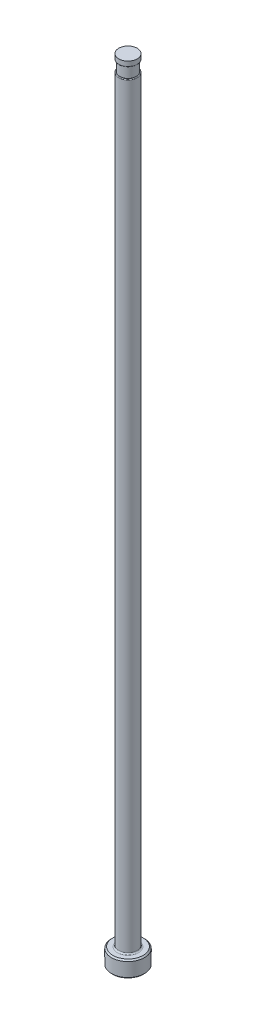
from build123d import *

# Parameters (mm, degrees)
CHAMFER1_SIZE     = 0.254
FILLET1_R         = 0.254
SKETCH2_W         = 0.2032
SKETCH2_H         = 2.032
D_SLOT_DEPTH      = 153.466131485
D_SLOT_DEPTH_BACK = 153.466131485
SKETCH5_W         = 0.00508
SKETCH5_H         = 1.016
FILLET2_R         = 0.127


with BuildPart() as part:
    # Sketch1 → Revolve1 (revolve)
    with BuildSketch(Plane.XY, mode=Mode.PRIVATE) as revolve1_sk:
        Polygon((0, 0), (-3.175, 0), (-3.175, 3.175), (-1.78562, 3.175), (-1.78562, 152.4), (0, 152.4), align=None)
    revolve(revolve1_sk.sketch.rotate(Axis((0, 259.958771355, 0), (0, -1, 0)), 270), axis=Axis((0, 259.958771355, 0), (0, -1, 0)))

    # Chamfer1
    chamfer1_edges = [part.edges().sort_by_distance(p)[0] for p in [
        (0, 3.175, -3.175),
        (0, 0, -3.175),
    ]]
    chamfer(chamfer1_edges, length=CHAMFER1_SIZE)

    # Fillet1
    fillet1_edges = [part.edges().sort_by_distance(p)[0] for p in [
        (0, 3.175, -1.78562),
    ]]
    fillet(fillet1_edges, radius=FILLET1_R)

    # Sketch2 → Vent Relief (revolve, cut)
    with BuildSketch(Plane.XY, mode=Mode.PRIVATE) as vent_relief_sk:
        with Locations((-1.68402, 150.368)):
            Rectangle(SKETCH2_W, SKETCH2_H)
    revolve(vent_relief_sk.sketch.rotate(Axis((0, 153.448281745, 0), (0, -1, 0)), 270), axis=Axis((0, 153.448281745, 0), (0, -1, 0)), mode=Mode.SUBTRACT)

    # Sketch3 → D-Slot (cut, two sides: drawn at the far end of the back side and taken through both)
    with BuildSketch(Plane.XY.offset(-D_SLOT_DEPTH_BACK)):
        with BuildLine():
            Line((-1.58242, 150.368), (-1.58242, 86.868))
            ThreePointArc((-1.58242, 86.868), (-1.633633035, 86.300038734), (-1.78562, 85.7504))
            Line((-1.78562, 85.7504), (-1.78562, 150.368))
            Line((-1.78562, 150.368), (-1.58242, 150.368))
        make_face()
    extrude(amount=D_SLOT_DEPTH + D_SLOT_DEPTH_BACK, mode=Mode.SUBTRACT)

    # Sketch5 → Vent Diameter (revolve, cut)
    with BuildSketch(Plane.XY, mode=Mode.PRIVATE) as vent_diameter_sk:
        with Locations((-1.78308, 151.892)):
            Rectangle(SKETCH5_W, SKETCH5_H)
    revolve(vent_diameter_sk.sketch.rotate(Axis((0, 152.687735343, 0), (0, -1, 0)), 90), axis=Axis((0, 152.687735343, 0), (0, -1, 0)), mode=Mode.SUBTRACT)

    # Fillet2
    fillet2_edges = [part.edges().sort_by_distance(p)[0] for p in [
        (1.527357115, 149.352, -0.924996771),
        (0, 151.384, 1.78054),
    ]]
    fillet(fillet2_edges, radius=FILLET2_R)


solid = part.part
